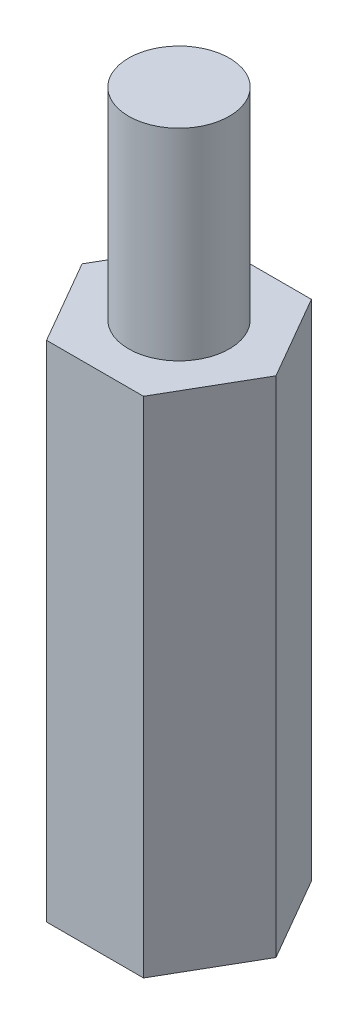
ISO-10303-21;
HEADER;
FILE_DESCRIPTION(('STEP AP214'),'2;1');
FILE_NAME('part.step','',(''),(''),'','','');
FILE_SCHEMA(('AUTOMOTIVE_DESIGN { 1 0 10303 214 1 1 1 1 }'));
ENDSEC;
DATA;
#1=APPLICATION_CONTEXT('core data for automotive mechanical design processes');
#2=APPLICATION_PROTOCOL_DEFINITION('international standard','automotive_design',2000,#1);
#3=PRODUCT_CONTEXT('',#1,'mechanical');
#4=PRODUCT('Part','Part','',(#3));
#5=PRODUCT_RELATED_PRODUCT_CATEGORY('part','',(#4));
#6=PRODUCT_DEFINITION_FORMATION('','',#4);
#7=PRODUCT_DEFINITION_CONTEXT('part definition',#1,'design');
#8=PRODUCT_DEFINITION('design','',#6,#7);
#9=PRODUCT_DEFINITION_SHAPE('','',#8);
#10=(LENGTH_UNIT() NAMED_UNIT(*) SI_UNIT(.MILLI.,.METRE.));
#11=(NAMED_UNIT(*) PLANE_ANGLE_UNIT() SI_UNIT($,.RADIAN.));
#12=(NAMED_UNIT(*) SI_UNIT($,.STERADIAN.) SOLID_ANGLE_UNIT());
#13=UNCERTAINTY_MEASURE_WITH_UNIT(LENGTH_MEASURE(1.E-05),#10,'distance_accuracy_value','');
#14=(GEOMETRIC_REPRESENTATION_CONTEXT(3) GLOBAL_UNCERTAINTY_ASSIGNED_CONTEXT((#13)) GLOBAL_UNIT_ASSIGNED_CONTEXT((#10,
#11,#12)) REPRESENTATION_CONTEXT('',''));
#15=CARTESIAN_POINT('',(0.,0.,0.));
#16=DIRECTION('',(0.,0.,1.));
#17=DIRECTION('',(1.,0.,0.));
#18=AXIS2_PLACEMENT_3D('',#15,#16,#17);
#19=CARTESIAN_POINT('',(0.,21.,0.));
#20=DIRECTION('',(0.,-1.,0.));
#21=DIRECTION('',(0.,0.,-1.));
#22=AXIS2_PLACEMENT_3D('',#19,#20,#21);
#23=CYLINDRICAL_SURFACE('',#22,1.5);
#24=CARTESIAN_POINT('',(0.,21.,0.));
#25=DIRECTION('',(0.,1.,0.));
#26=DIRECTION('',(0.,0.,1.));
#27=AXIS2_PLACEMENT_3D('',#24,#25,#26);
#28=CIRCLE('',#27,1.5);
#29=CARTESIAN_POINT('',(0.,21.,1.5));
#30=VERTEX_POINT('',#29);
#31=EDGE_CURVE('E11',#30,#30,#28,.T.);
#32=ORIENTED_EDGE('',*,*,#31,.F.);
#33=EDGE_LOOP('',(#32));
#34=FACE_BOUND('',#33,.T.);
#35=CARTESIAN_POINT('',(0.,15.,0.));
#36=DIRECTION('',(0.,1.,0.));
#37=DIRECTION('',(0.,0.,1.));
#38=AXIS2_PLACEMENT_3D('',#35,#36,#37);
#39=CIRCLE('',#38,1.5);
#40=CARTESIAN_POINT('',(0.,15.,1.5));
#41=VERTEX_POINT('',#40);
#42=EDGE_CURVE('E48',#41,#41,#39,.T.);
#43=ORIENTED_EDGE('',*,*,#42,.T.);
#44=EDGE_LOOP('',(#43));
#45=FACE_BOUND('',#44,.T.);
#46=ADVANCED_FACE('F45',(#34,#45),#23,.T.);
#47=CARTESIAN_POINT('',(0.,21.,0.));
#48=DIRECTION('',(0.,1.,0.));
#49=DIRECTION('',(0.,0.,1.));
#50=AXIS2_PLACEMENT_3D('',#47,#48,#49);
#51=PLANE('',#50);
#52=ORIENTED_EDGE('',*,*,#31,.T.);
#53=EDGE_LOOP('',(#52));
#54=FACE_BOUND('',#53,.T.);
#55=ADVANCED_FACE('F60',(#54),#51,.T.);
#56=CARTESIAN_POINT('',(0.,15.,0.));
#57=DIRECTION('',(0.,1.,0.));
#58=DIRECTION('',(0.,0.,1.));
#59=AXIS2_PLACEMENT_3D('',#56,#57,#58);
#60=PLANE('',#59);
#61=ORIENTED_EDGE('',*,*,#42,.F.);
#62=EDGE_LOOP('',(#61));
#63=FACE_BOUND('',#62,.T.);
#64=ADVANCED_FACE('F58',(#63),#60,.F.);
#65=CLOSED_SHELL('',(#46,#55,#64));
#66=MANIFOLD_SOLID_BREP('B2',#65);
#67=CARTESIAN_POINT('',(0.,15.,0.));
#68=DIRECTION('',(0.,1.,0.));
#69=DIRECTION('',(0.,0.,1.));
#70=AXIS2_PLACEMENT_3D('',#67,#68,#69);
#71=PLANE('',#70);
#72=DIRECTION('',(0.500000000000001,0.,-0.866025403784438));
#73=VECTOR('',#72,1.);
#74=CARTESIAN_POINT('',(1.44337567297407,15.,2.5));
#75=LINE('',#74,#73);
#76=CARTESIAN_POINT('',(1.44337567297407,15.,2.5));
#77=VERTEX_POINT('',#76);
#78=CARTESIAN_POINT('',(2.88675134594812,15.,0.));
#79=VERTEX_POINT('',#78);
#80=EDGE_CURVE('E182',#77,#79,#75,.T.);
#81=ORIENTED_EDGE('',*,*,#80,.T.);
#82=DIRECTION('',(-0.499999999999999,0.,-0.866025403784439));
#83=VECTOR('',#82,1.);
#84=CARTESIAN_POINT('',(2.88675134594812,15.,0.));
#85=LINE('',#84,#83);
#86=CARTESIAN_POINT('',(1.44337567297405,15.,-2.5));
#87=VERTEX_POINT('',#86);
#88=EDGE_CURVE('E140',#79,#87,#85,.T.);
#89=ORIENTED_EDGE('',*,*,#88,.T.);
#90=DIRECTION('',(-1.,0.,0.));
#91=VECTOR('',#90,1.);
#92=CARTESIAN_POINT('',(1.44337567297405,15.,-2.5));
#93=LINE('',#92,#91);
#94=CARTESIAN_POINT('',(-1.44337567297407,15.,-2.5));
#95=VERTEX_POINT('',#94);
#96=EDGE_CURVE('E153',#87,#95,#93,.T.);
#97=ORIENTED_EDGE('',*,*,#96,.T.);
#98=DIRECTION('',(-0.5,0.,0.866025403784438));
#99=VECTOR('',#98,1.);
#100=CARTESIAN_POINT('',(-1.44337567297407,15.,-2.5));
#101=LINE('',#100,#99);
#102=CARTESIAN_POINT('',(-2.88675134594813,15.,0.));
#103=VERTEX_POINT('',#102);
#104=EDGE_CURVE('E147',#95,#103,#101,.T.);
#105=ORIENTED_EDGE('',*,*,#104,.T.);
#106=DIRECTION('',(0.5,0.,0.866025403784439));
#107=VECTOR('',#106,1.);
#108=CARTESIAN_POINT('',(-2.88675134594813,15.,0.));
#109=LINE('',#108,#107);
#110=CARTESIAN_POINT('',(-1.44337567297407,15.,2.5));
#111=VERTEX_POINT('',#110);
#112=EDGE_CURVE('E151',#103,#111,#109,.T.);
#113=ORIENTED_EDGE('',*,*,#112,.T.);
#114=DIRECTION('',(1.,0.,0.));
#115=VECTOR('',#114,1.);
#116=CARTESIAN_POINT('',(-1.44337567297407,15.,2.5));
#117=LINE('',#116,#115);
#118=EDGE_CURVE('E103',#111,#77,#117,.T.);
#119=ORIENTED_EDGE('',*,*,#118,.T.);
#120=EDGE_LOOP('',(#81,#89,#97,#105,#113,#119));
#121=FACE_BOUND('',#120,.T.);
#122=CARTESIAN_POINT('',(0.,15.,0.));
#123=DIRECTION('',(0.,1.,0.));
#124=DIRECTION('',(0.,0.,1.));
#125=AXIS2_PLACEMENT_3D('',#122,#123,#124);
#126=CIRCLE('',#125,1.5);
#127=CARTESIAN_POINT('',(0.,15.,1.5));
#128=VERTEX_POINT('',#127);
#129=EDGE_CURVE('E175',#128,#128,#126,.T.);
#130=ORIENTED_EDGE('',*,*,#129,.F.);
#131=EDGE_LOOP('',(#130));
#132=FACE_BOUND('',#131,.T.);
#133=ADVANCED_FACE('F86',(#121,#132),#71,.T.);
#134=CARTESIAN_POINT('',(0.,0.,0.));
#135=DIRECTION('',(0.,1.,0.));
#136=DIRECTION('',(0.,0.,1.));
#137=AXIS2_PLACEMENT_3D('',#134,#135,#136);
#138=PLANE('',#137);
#139=DIRECTION('',(0.500000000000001,0.,-0.866025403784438));
#140=VECTOR('',#139,1.);
#141=CARTESIAN_POINT('',(1.44337567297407,0.,2.5));
#142=LINE('',#141,#140);
#143=CARTESIAN_POINT('',(1.44337567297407,0.,2.5));
#144=VERTEX_POINT('',#143);
#145=CARTESIAN_POINT('',(2.88675134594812,0.,0.));
#146=VERTEX_POINT('',#145);
#147=EDGE_CURVE('E171',#144,#146,#142,.T.);
#148=ORIENTED_EDGE('',*,*,#147,.F.);
#149=DIRECTION('',(1.,0.,0.));
#150=VECTOR('',#149,1.);
#151=CARTESIAN_POINT('',(-1.44337567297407,0.,2.5));
#152=LINE('',#151,#150);
#153=CARTESIAN_POINT('',(-1.44337567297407,0.,2.5));
#154=VERTEX_POINT('',#153);
#155=EDGE_CURVE('E132',#154,#144,#152,.T.);
#156=ORIENTED_EDGE('',*,*,#155,.F.);
#157=DIRECTION('',(0.5,0.,0.866025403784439));
#158=VECTOR('',#157,1.);
#159=CARTESIAN_POINT('',(-2.88675134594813,0.,0.));
#160=LINE('',#159,#158);
#161=CARTESIAN_POINT('',(-2.88675134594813,0.,0.));
#162=VERTEX_POINT('',#161);
#163=EDGE_CURVE('E126',#162,#154,#160,.T.);
#164=ORIENTED_EDGE('',*,*,#163,.F.);
#165=DIRECTION('',(-0.5,0.,0.866025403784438));
#166=VECTOR('',#165,1.);
#167=CARTESIAN_POINT('',(-1.44337567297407,0.,-2.5));
#168=LINE('',#167,#166);
#169=CARTESIAN_POINT('',(-1.44337567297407,0.,-2.5));
#170=VERTEX_POINT('',#169);
#171=EDGE_CURVE('E161',#170,#162,#168,.T.);
#172=ORIENTED_EDGE('',*,*,#171,.F.);
#173=DIRECTION('',(-1.,0.,0.));
#174=VECTOR('',#173,1.);
#175=CARTESIAN_POINT('',(1.44337567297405,0.,-2.5));
#176=LINE('',#175,#174);
#177=CARTESIAN_POINT('',(1.44337567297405,0.,-2.5));
#178=VERTEX_POINT('',#177);
#179=EDGE_CURVE('E177',#178,#170,#176,.T.);
#180=ORIENTED_EDGE('',*,*,#179,.F.);
#181=DIRECTION('',(-0.499999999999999,0.,-0.866025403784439));
#182=VECTOR('',#181,1.);
#183=CARTESIAN_POINT('',(2.88675134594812,0.,0.));
#184=LINE('',#183,#182);
#185=EDGE_CURVE('E174',#146,#178,#184,.T.);
#186=ORIENTED_EDGE('',*,*,#185,.F.);
#187=EDGE_LOOP('',(#148,#156,#164,#172,#180,#186));
#188=FACE_BOUND('',#187,.T.);
#189=CARTESIAN_POINT('',(0.,0.,0.));
#190=DIRECTION('',(0.,1.,0.));
#191=DIRECTION('',(0.,0.,1.));
#192=AXIS2_PLACEMENT_3D('',#189,#190,#191);
#193=CIRCLE('',#192,1.5);
#194=CARTESIAN_POINT('',(0.,0.,1.5));
#195=VERTEX_POINT('',#194);
#196=EDGE_CURVE('E275',#195,#195,#193,.T.);
#197=ORIENTED_EDGE('',*,*,#196,.T.);
#198=EDGE_LOOP('',(#197));
#199=FACE_BOUND('',#198,.T.);
#200=ADVANCED_FACE('F191',(#188,#199),#138,.F.);
#201=CARTESIAN_POINT('',(1.44337567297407,15.,2.5));
#202=DIRECTION('',(-0.866025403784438,0.,-0.500000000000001));
#203=DIRECTION('',(-0.500000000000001,0.,0.866025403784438));
#204=AXIS2_PLACEMENT_3D('',#201,#202,#203);
#205=PLANE('',#204);
#206=ORIENTED_EDGE('',*,*,#147,.T.);
#207=DIRECTION('',(0.,-1.,0.));
#208=VECTOR('',#207,1.);
#209=CARTESIAN_POINT('',(2.88675134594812,15.,0.));
#210=LINE('',#209,#208);
#211=EDGE_CURVE('E43',#79,#146,#210,.T.);
#212=ORIENTED_EDGE('',*,*,#211,.F.);
#213=ORIENTED_EDGE('',*,*,#80,.F.);
#214=DIRECTION('',(0.,-1.,0.));
#215=VECTOR('',#214,1.);
#216=CARTESIAN_POINT('',(1.44337567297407,15.,2.5));
#217=LINE('',#216,#215);
#218=EDGE_CURVE('E167',#77,#144,#217,.T.);
#219=ORIENTED_EDGE('',*,*,#218,.T.);
#220=EDGE_LOOP('',(#206,#212,#213,#219));
#221=FACE_BOUND('',#220,.T.);
#222=ADVANCED_FACE('F88',(#221),#205,.F.);
#223=CARTESIAN_POINT('',(2.88675134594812,15.,0.));
#224=DIRECTION('',(-0.866025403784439,0.,0.499999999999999));
#225=DIRECTION('',(0.5,0.,0.866025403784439));
#226=AXIS2_PLACEMENT_3D('',#223,#224,#225);
#227=PLANE('',#226);
#228=ORIENTED_EDGE('',*,*,#185,.T.);
#229=DIRECTION('',(0.,-1.,0.));
#230=VECTOR('',#229,1.);
#231=CARTESIAN_POINT('',(1.44337567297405,15.,-2.5));
#232=LINE('',#231,#230);
#233=EDGE_CURVE('E95',#87,#178,#232,.T.);
#234=ORIENTED_EDGE('',*,*,#233,.F.);
#235=ORIENTED_EDGE('',*,*,#88,.F.);
#236=ORIENTED_EDGE('',*,*,#211,.T.);
#237=EDGE_LOOP('',(#228,#234,#235,#236));
#238=FACE_BOUND('',#237,.T.);
#239=ADVANCED_FACE('F216',(#238),#227,.F.);
#240=CARTESIAN_POINT('',(1.44337567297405,15.,-2.5));
#241=DIRECTION('',(0.,0.,1.));
#242=DIRECTION('',(1.,0.,0.));
#243=AXIS2_PLACEMENT_3D('',#240,#241,#242);
#244=PLANE('',#243);
#245=ORIENTED_EDGE('',*,*,#179,.T.);
#246=DIRECTION('',(0.,-1.,0.));
#247=VECTOR('',#246,1.);
#248=CARTESIAN_POINT('',(-1.44337567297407,15.,-2.5));
#249=LINE('',#248,#247);
#250=EDGE_CURVE('E162',#95,#170,#249,.T.);
#251=ORIENTED_EDGE('',*,*,#250,.F.);
#252=ORIENTED_EDGE('',*,*,#96,.F.);
#253=ORIENTED_EDGE('',*,*,#233,.T.);
#254=EDGE_LOOP('',(#245,#251,#252,#253));
#255=FACE_BOUND('',#254,.T.);
#256=ADVANCED_FACE('F188',(#255),#244,.F.);
#257=CARTESIAN_POINT('',(-1.44337567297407,15.,-2.5));
#258=DIRECTION('',(0.866025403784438,0.,0.5));
#259=DIRECTION('',(0.5,0.,-0.866025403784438));
#260=AXIS2_PLACEMENT_3D('',#257,#258,#259);
#261=PLANE('',#260);
#262=ORIENTED_EDGE('',*,*,#171,.T.);
#263=DIRECTION('',(0.,-1.,0.));
#264=VECTOR('',#263,1.);
#265=CARTESIAN_POINT('',(-2.88675134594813,15.,0.));
#266=LINE('',#265,#264);
#267=EDGE_CURVE('E158',#103,#162,#266,.T.);
#268=ORIENTED_EDGE('',*,*,#267,.F.);
#269=ORIENTED_EDGE('',*,*,#104,.F.);
#270=ORIENTED_EDGE('',*,*,#250,.T.);
#271=EDGE_LOOP('',(#262,#268,#269,#270));
#272=FACE_BOUND('',#271,.T.);
#273=ADVANCED_FACE('F159',(#272),#261,.F.);
#274=CARTESIAN_POINT('',(-2.88675134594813,15.,0.));
#275=DIRECTION('',(0.866025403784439,0.,-0.5));
#276=DIRECTION('',(-0.5,0.,-0.866025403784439));
#277=AXIS2_PLACEMENT_3D('',#274,#275,#276);
#278=PLANE('',#277);
#279=ORIENTED_EDGE('',*,*,#163,.T.);
#280=DIRECTION('',(0.,-1.,0.));
#281=VECTOR('',#280,1.);
#282=CARTESIAN_POINT('',(-1.44337567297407,15.,2.5));
#283=LINE('',#282,#281);
#284=EDGE_CURVE('E163',#111,#154,#283,.T.);
#285=ORIENTED_EDGE('',*,*,#284,.F.);
#286=ORIENTED_EDGE('',*,*,#112,.F.);
#287=ORIENTED_EDGE('',*,*,#267,.T.);
#288=EDGE_LOOP('',(#279,#285,#286,#287));
#289=FACE_BOUND('',#288,.T.);
#290=ADVANCED_FACE('F165',(#289),#278,.F.);
#291=CARTESIAN_POINT('',(-1.44337567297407,15.,2.5));
#292=DIRECTION('',(0.,0.,-1.));
#293=DIRECTION('',(-1.,0.,0.));
#294=AXIS2_PLACEMENT_3D('',#291,#292,#293);
#295=PLANE('',#294);
#296=ORIENTED_EDGE('',*,*,#155,.T.);
#297=ORIENTED_EDGE('',*,*,#218,.F.);
#298=ORIENTED_EDGE('',*,*,#118,.F.);
#299=ORIENTED_EDGE('',*,*,#284,.T.);
#300=EDGE_LOOP('',(#296,#297,#298,#299));
#301=FACE_BOUND('',#300,.T.);
#302=ADVANCED_FACE('F196',(#301),#295,.F.);
#303=CARTESIAN_POINT('',(0.,15.,0.));
#304=DIRECTION('',(0.,-1.,0.));
#305=DIRECTION('',(0.,0.,-1.));
#306=AXIS2_PLACEMENT_3D('',#303,#304,#305);
#307=CYLINDRICAL_SURFACE('',#306,1.5);
#308=ORIENTED_EDGE('',*,*,#129,.T.);
#309=EDGE_LOOP('',(#308));
#310=FACE_BOUND('',#309,.T.);
#311=ORIENTED_EDGE('',*,*,#196,.F.);
#312=EDGE_LOOP('',(#311));
#313=FACE_BOUND('',#312,.T.);
#314=ADVANCED_FACE('F198',(#310,#313),#307,.F.);
#315=CLOSED_SHELL('',(#133,#200,#222,#239,#256,#273,#290,#302,#314));
#316=MANIFOLD_SOLID_BREP('B6',#315);
#317=ADVANCED_BREP_SHAPE_REPRESENTATION('',(#18,#66,#316),#14);
#318=SHAPE_DEFINITION_REPRESENTATION(#9,#317);
ENDSEC;
END-ISO-10303-21;
